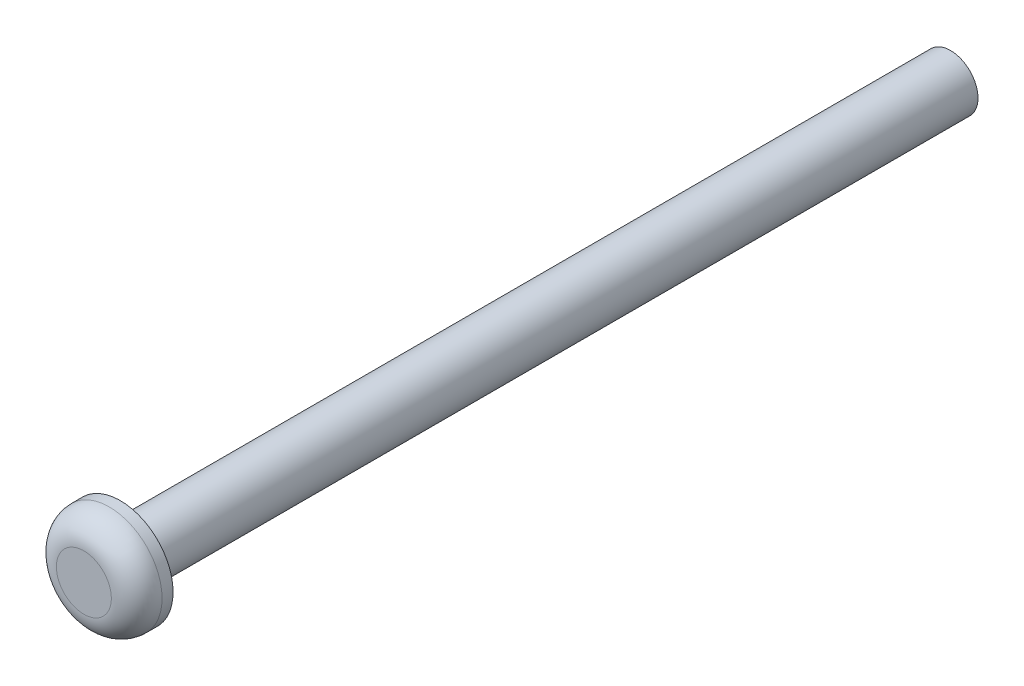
from build123d import *

# Parameters (mm, degrees)
SKETCH1_R           = 3.175
BOSS_EXTRUDE1_DEPTH = 2.1844
SKETCH3_R           = 1.651
BOSS_EXTRUDE2_DEPTH = 52.07
FILLET1_R           = 1.524


with BuildPart() as part:
    # Sketch1 → Boss-Extrude1 (new body)
    with BuildSketch(Plane.XY):
        Circle(SKETCH1_R)
    extrude(amount=BOSS_EXTRUDE1_DEPTH)

    # Sketch3 → Boss-Extrude2 (add)
    with BuildSketch(Plane.XY.offset(2.1844)):
        Circle(SKETCH3_R)
    extrude(amount=-BOSS_EXTRUDE2_DEPTH)

    # Fillet1
    fillet1_edges = [part.edges().sort_by_distance(p)[0] for p in [
        (-3.175, 0, 2.1844),
    ]]
    fillet(fillet1_edges, radius=FILLET1_R)


solid = part.part
